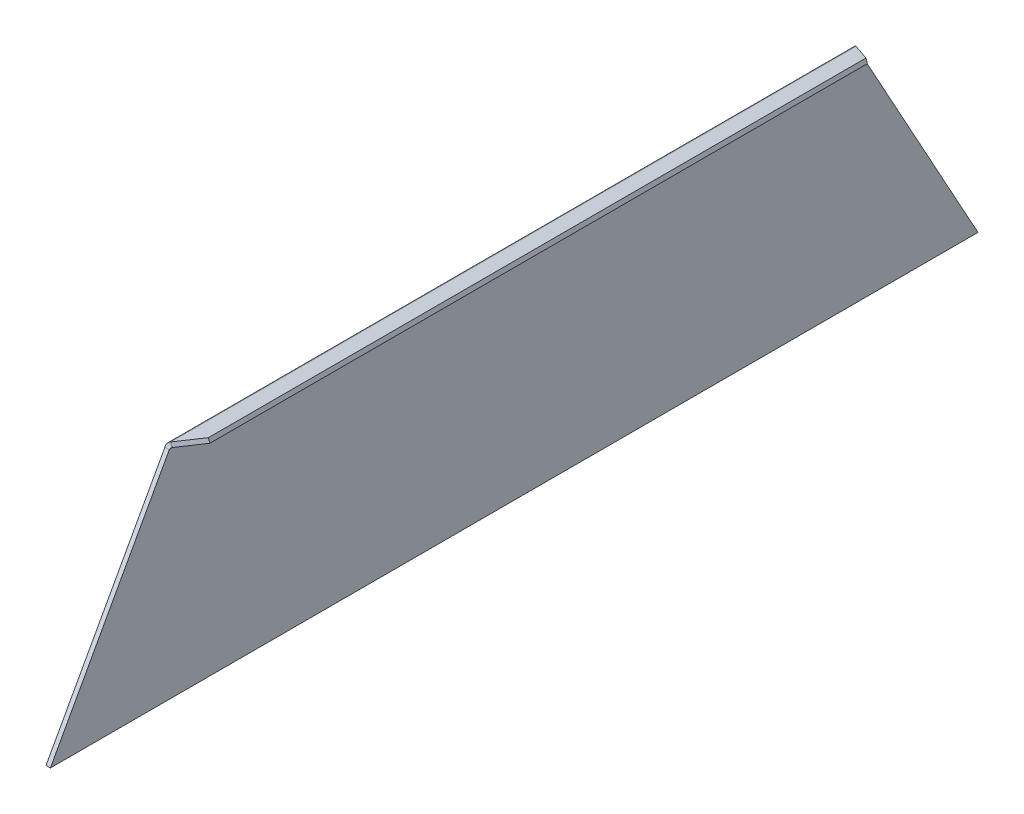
ISO-10303-21;
HEADER;
FILE_DESCRIPTION(('STEP AP214'),'2;1');
FILE_NAME('part.step','',(''),(''),'','','');
FILE_SCHEMA(('AUTOMOTIVE_DESIGN { 1 0 10303 214 1 1 1 1 }'));
ENDSEC;
DATA;
#1=APPLICATION_CONTEXT('core data for automotive mechanical design processes');
#2=APPLICATION_PROTOCOL_DEFINITION('international standard','automotive_design',2000,#1);
#3=PRODUCT_CONTEXT('',#1,'mechanical');
#4=PRODUCT('Part','Part','',(#3));
#5=PRODUCT_RELATED_PRODUCT_CATEGORY('part','',(#4));
#6=PRODUCT_DEFINITION_FORMATION('','',#4);
#7=PRODUCT_DEFINITION_CONTEXT('part definition',#1,'design');
#8=PRODUCT_DEFINITION('design','',#6,#7);
#9=PRODUCT_DEFINITION_SHAPE('','',#8);
#10=(LENGTH_UNIT() NAMED_UNIT(*) SI_UNIT(.MILLI.,.METRE.));
#11=(NAMED_UNIT(*) PLANE_ANGLE_UNIT() SI_UNIT($,.RADIAN.));
#12=(NAMED_UNIT(*) SI_UNIT($,.STERADIAN.) SOLID_ANGLE_UNIT());
#13=UNCERTAINTY_MEASURE_WITH_UNIT(LENGTH_MEASURE(1.E-05),#10,'distance_accuracy_value','');
#14=(GEOMETRIC_REPRESENTATION_CONTEXT(3) GLOBAL_UNCERTAINTY_ASSIGNED_CONTEXT((#13)) GLOBAL_UNIT_ASSIGNED_CONTEXT((#10,
#11,#12)) REPRESENTATION_CONTEXT('',''));
#15=CARTESIAN_POINT('',(0.,0.,0.));
#16=DIRECTION('',(0.,0.,1.));
#17=DIRECTION('',(1.,0.,0.));
#18=AXIS2_PLACEMENT_3D('',#15,#16,#17);
#19=CARTESIAN_POINT('',(50.120276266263,421.579172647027,602.5));
#20=DIRECTION('',(-0.342020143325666,0.93969262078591,0.));
#21=DIRECTION('',(0.,0.,1.));
#22=AXIS2_PLACEMENT_3D('',#19,#20,#21);
#23=PLANE('',#22);
#24=DIRECTION('',(0.823373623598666,0.299683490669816,0.481918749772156));
#25=VECTOR('',#24,1.);
#26=CARTESIAN_POINT('',(-372.741403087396,267.670108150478,-850.));
#27=LINE('',#26,#25);
#28=CARTESIAN_POINT('',(6.57979856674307,405.731734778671,-627.984144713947));
#29=VERTEX_POINT('',#28);
#30=CARTESIAN_POINT('',(50.1202762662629,421.579172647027,-602.5));
#31=VERTEX_POINT('',#30);
#32=EDGE_CURVE('E78',#29,#31,#27,.T.);
#33=ORIENTED_EDGE('',*,*,#32,.F.);
#34=DIRECTION('',(0.,0.,1.));
#35=VECTOR('',#34,1.);
#36=CARTESIAN_POINT('',(6.57979856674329,405.731734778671,602.5));
#37=LINE('',#36,#35);
#38=CARTESIAN_POINT('',(6.57979856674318,405.731734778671,627.984144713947));
#39=VERTEX_POINT('',#38);
#40=EDGE_CURVE('E71',#29,#39,#37,.T.);
#41=ORIENTED_EDGE('',*,*,#40,.T.);
#42=DIRECTION('',(-0.823373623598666,-0.299683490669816,0.481918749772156));
#43=VECTOR('',#42,1.);
#44=CARTESIAN_POINT('',(-372.741403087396,267.670108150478,850.));
#45=LINE('',#44,#43);
#46=CARTESIAN_POINT('',(50.120276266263,421.579172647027,602.5));
#47=VERTEX_POINT('',#46);
#48=EDGE_CURVE('E86',#47,#39,#45,.T.);
#49=ORIENTED_EDGE('',*,*,#48,.F.);
#50=DIRECTION('',(0.,0.,1.));
#51=VECTOR('',#50,1.);
#52=CARTESIAN_POINT('',(50.120276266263,421.579172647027,602.5));
#53=LINE('',#52,#51);
#54=EDGE_CURVE('E431',#31,#47,#53,.T.);
#55=ORIENTED_EDGE('',*,*,#54,.F.);
#56=EDGE_LOOP('',(#33,#41,#49,#55));
#57=FACE_BOUND('',#56,.T.);
#58=ADVANCED_FACE('F59',(#57),#23,.T.);
#59=CARTESIAN_POINT('',(-370.005241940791,260.15256718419,850.));
#60=DIRECTION('',(-0.452855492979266,-0.164825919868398,-0.876215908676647));
#61=DIRECTION('',(0.823373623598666,0.299683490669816,-0.481918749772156));
#62=AXIS2_PLACEMENT_3D('',#59,#60,#61);
#63=PLANE('',#62);
#64=CARTESIAN_POINT('',(9.31595971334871,398.214193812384,627.984144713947));
#65=CARTESIAN_POINT('',(6.57979856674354,405.731734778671,627.984144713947));
#66=B_SPLINE_CURVE_WITH_KNOTS('',1,(#64,#65),.UNSPECIFIED.,.F.,.F.,(2,2),(0.,1.),.UNSPECIFIED.);
#67=CARTESIAN_POINT('',(9.31595971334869,398.214193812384,627.984144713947));
#68=VERTEX_POINT('',#67);
#69=EDGE_CURVE('E350',#68,#39,#66,.T.);
#70=ORIENTED_EDGE('',*,*,#69,.F.);
#71=DIRECTION('',(-0.823373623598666,-0.299683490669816,0.481918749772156));
#72=VECTOR('',#71,1.);
#73=CARTESIAN_POINT('',(-370.005241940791,260.15256718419,850.));
#74=LINE('',#73,#72);
#75=CARTESIAN_POINT('',(52.8564374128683,414.06163168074,602.5));
#76=VERTEX_POINT('',#75);
#77=EDGE_CURVE('E439',#76,#68,#74,.T.);
#78=ORIENTED_EDGE('',*,*,#77,.F.);
#79=DIRECTION('',(-0.342020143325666,0.93969262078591,0.));
#80=VECTOR('',#79,1.);
#81=CARTESIAN_POINT('',(52.8564374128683,414.06163168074,602.5));
#82=LINE('',#81,#80);
#83=EDGE_CURVE('E450',#76,#47,#82,.T.);
#84=ORIENTED_EDGE('',*,*,#83,.T.);
#85=ORIENTED_EDGE('',*,*,#48,.T.);
#86=EDGE_LOOP('',(#70,#78,#84,#85));
#87=FACE_BOUND('',#86,.T.);
#88=ADVANCED_FACE('F201',(#87),#63,.F.);
#89=CARTESIAN_POINT('',(-370.005241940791,260.15256718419,-850.));
#90=DIRECTION('',(-0.452855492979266,-0.164825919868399,0.876215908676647));
#91=DIRECTION('',(-0.823373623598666,-0.299683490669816,-0.481918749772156));
#92=AXIS2_PLACEMENT_3D('',#89,#90,#91);
#93=PLANE('',#92);
#94=CARTESIAN_POINT('',(6.57979856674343,405.731734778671,-627.984144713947));
#95=CARTESIAN_POINT('',(9.31595971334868,398.214193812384,-627.984144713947));
#96=B_SPLINE_CURVE_WITH_KNOTS('',1,(#94,#95),.UNSPECIFIED.,.F.,.F.,(2,2),(0.,1.),.UNSPECIFIED.);
#97=CARTESIAN_POINT('',(9.31595971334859,398.214193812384,-627.984144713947));
#98=VERTEX_POINT('',#97);
#99=EDGE_CURVE('E12',#29,#98,#96,.T.);
#100=ORIENTED_EDGE('',*,*,#99,.F.);
#101=ORIENTED_EDGE('',*,*,#32,.T.);
#102=DIRECTION('',(-0.342020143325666,0.93969262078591,0.));
#103=VECTOR('',#102,1.);
#104=CARTESIAN_POINT('',(52.8564374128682,414.06163168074,-602.5));
#105=LINE('',#104,#103);
#106=CARTESIAN_POINT('',(52.8564374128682,414.06163168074,-602.5));
#107=VERTEX_POINT('',#106);
#108=EDGE_CURVE('E447',#107,#31,#105,.T.);
#109=ORIENTED_EDGE('',*,*,#108,.F.);
#110=DIRECTION('',(0.823373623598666,0.299683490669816,0.481918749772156));
#111=VECTOR('',#110,1.);
#112=CARTESIAN_POINT('',(-370.005241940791,260.15256718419,-850.));
#113=LINE('',#112,#111);
#114=EDGE_CURVE('E445',#98,#107,#113,.T.);
#115=ORIENTED_EDGE('',*,*,#114,.F.);
#116=EDGE_LOOP('',(#100,#101,#109,#115));
#117=FACE_BOUND('',#116,.T.);
#118=ADVANCED_FACE('F61',(#117),#93,.F.);
#119=CARTESIAN_POINT('',(52.8564374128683,414.06163168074,602.5));
#120=DIRECTION('',(-0.93969262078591,-0.342020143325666,0.));
#121=DIRECTION('',(0.,0.,-1.));
#122=AXIS2_PLACEMENT_3D('',#119,#120,#121);
#123=PLANE('',#122);
#124=ORIENTED_EDGE('',*,*,#54,.T.);
#125=ORIENTED_EDGE('',*,*,#83,.F.);
#126=DIRECTION('',(0.,0.,1.));
#127=VECTOR('',#126,1.);
#128=CARTESIAN_POINT('',(52.8564374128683,414.06163168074,602.5));
#129=LINE('',#128,#127);
#130=EDGE_CURVE('E443',#107,#76,#129,.T.);
#131=ORIENTED_EDGE('',*,*,#130,.F.);
#132=ORIENTED_EDGE('',*,*,#108,.T.);
#133=EDGE_LOOP('',(#124,#125,#131,#132));
#134=FACE_BOUND('',#133,.T.);
#135=ADVANCED_FACE('F193',(#134),#123,.F.);
#136=CARTESIAN_POINT('',(52.8564374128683,414.06163168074,602.5));
#137=DIRECTION('',(-0.342020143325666,0.93969262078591,0.));
#138=DIRECTION('',(0.,0.,1.));
#139=AXIS2_PLACEMENT_3D('',#136,#137,#138);
#140=PLANE('',#139);
#141=DIRECTION('',(0.,0.,1.));
#142=VECTOR('',#141,1.);
#143=CARTESIAN_POINT('',(9.31595971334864,398.214193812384,602.5));
#144=LINE('',#143,#142);
#145=EDGE_CURVE('E440',#98,#68,#144,.T.);
#146=ORIENTED_EDGE('',*,*,#145,.F.);
#147=ORIENTED_EDGE('',*,*,#114,.T.);
#148=ORIENTED_EDGE('',*,*,#130,.T.);
#149=ORIENTED_EDGE('',*,*,#77,.T.);
#150=EDGE_LOOP('',(#146,#147,#148,#149));
#151=FACE_BOUND('',#150,.T.);
#152=ADVANCED_FACE('F196',(#151),#140,.F.);
#153=CARTESIAN_POINT('',(8.,0.,850.));
#154=DIRECTION('',(0.,1.,0.));
#155=DIRECTION('',(0.,0.,1.));
#156=AXIS2_PLACEMENT_3D('',#153,#154,#155);
#157=PLANE('',#156);
#158=DIRECTION('',(0.,0.,-1.));
#159=VECTOR('',#158,1.);
#160=CARTESIAN_POINT('',(0.,0.,850.));
#161=LINE('',#160,#159);
#162=CARTESIAN_POINT('',(0.,0.,850.));
#163=VERTEX_POINT('',#162);
#164=CARTESIAN_POINT('',(0.,0.,-850.));
#165=VERTEX_POINT('',#164);
#166=EDGE_CURVE('E358',#163,#165,#161,.T.);
#167=ORIENTED_EDGE('',*,*,#166,.T.);
#168=DIRECTION('',(-1.,0.,0.));
#169=VECTOR('',#168,1.);
#170=CARTESIAN_POINT('',(8.,0.,-850.));
#171=LINE('',#170,#169);
#172=CARTESIAN_POINT('',(8.,0.,-850.));
#173=VERTEX_POINT('',#172);
#174=EDGE_CURVE('E173',#173,#165,#171,.T.);
#175=ORIENTED_EDGE('',*,*,#174,.F.);
#176=DIRECTION('',(0.,0.,-1.));
#177=VECTOR('',#176,1.);
#178=CARTESIAN_POINT('',(8.,0.,850.));
#179=LINE('',#178,#177);
#180=CARTESIAN_POINT('',(8.,0.,850.));
#181=VERTEX_POINT('',#180);
#182=EDGE_CURVE('E161',#181,#173,#179,.T.);
#183=ORIENTED_EDGE('',*,*,#182,.F.);
#184=DIRECTION('',(-1.,0.,0.));
#185=VECTOR('',#184,1.);
#186=CARTESIAN_POINT('',(8.,0.,850.));
#187=LINE('',#186,#185);
#188=EDGE_CURVE('E165',#181,#163,#187,.T.);
#189=ORIENTED_EDGE('',*,*,#188,.T.);
#190=EDGE_LOOP('',(#167,#175,#183,#189));
#191=FACE_BOUND('',#190,.T.);
#192=ADVANCED_FACE('F199',(#191),#157,.F.);
#193=CARTESIAN_POINT('',(8.,450.,602.5));
#194=DIRECTION('',(-1.,0.,0.));
#195=DIRECTION('',(0.,0.,1.));
#196=AXIS2_PLACEMENT_3D('',#193,#194,#195);
#197=PLANE('',#196);
#198=DIRECTION('',(0.,0.876215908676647,0.481918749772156));
#199=VECTOR('',#198,1.);
#200=CARTESIAN_POINT('',(8.,0.,-850.));
#201=LINE('',#200,#199);
#202=CARTESIAN_POINT('',(8.,396.334808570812,-632.015855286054));
#203=VERTEX_POINT('',#202);
#204=EDGE_CURVE('E156',#173,#203,#201,.T.);
#205=ORIENTED_EDGE('',*,*,#204,.T.);
#206=DIRECTION('',(0.,0.,1.));
#207=VECTOR('',#206,1.);
#208=CARTESIAN_POINT('',(8.,396.334808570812,602.5));
#209=LINE('',#208,#207);
#210=CARTESIAN_POINT('',(8.,396.334808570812,632.015855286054));
#211=VERTEX_POINT('',#210);
#212=EDGE_CURVE('E148',#203,#211,#209,.T.);
#213=ORIENTED_EDGE('',*,*,#212,.T.);
#214=DIRECTION('',(0.,-0.876215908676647,0.481918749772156));
#215=VECTOR('',#214,1.);
#216=CARTESIAN_POINT('',(8.,0.,850.));
#217=LINE('',#216,#215);
#218=EDGE_CURVE('E155',#211,#181,#217,.T.);
#219=ORIENTED_EDGE('',*,*,#218,.T.);
#220=ORIENTED_EDGE('',*,*,#182,.T.);
#221=EDGE_LOOP('',(#205,#213,#219,#220));
#222=FACE_BOUND('',#221,.T.);
#223=ADVANCED_FACE('F159',(#222),#197,.F.);
#224=CARTESIAN_POINT('',(8.,0.,850.));
#225=DIRECTION('',(0.,-0.481918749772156,-0.876215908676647));
#226=DIRECTION('',(0.,0.876215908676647,-0.481918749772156));
#227=AXIS2_PLACEMENT_3D('',#224,#225,#226);
#228=PLANE('',#227);
#229=ORIENTED_EDGE('',*,*,#218,.F.);
#230=CARTESIAN_POINT('',(0.,396.334808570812,632.015855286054));
#231=CARTESIAN_POINT('',(8.,396.334808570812,632.015855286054));
#232=B_SPLINE_CURVE_WITH_KNOTS('',1,(#230,#231),.UNSPECIFIED.,.F.,.F.,(2,2),(0.,1.),.UNSPECIFIED.);
#233=CARTESIAN_POINT('',(0.,396.334808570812,632.015855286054));
#234=VERTEX_POINT('',#233);
#235=EDGE_CURVE('E353',#211,#234,#232,.F.);
#236=ORIENTED_EDGE('',*,*,#235,.T.);
#237=DIRECTION('',(0.,-0.876215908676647,0.481918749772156));
#238=VECTOR('',#237,1.);
#239=CARTESIAN_POINT('',(0.,0.,850.));
#240=LINE('',#239,#238);
#241=EDGE_CURVE('E365',#234,#163,#240,.T.);
#242=ORIENTED_EDGE('',*,*,#241,.T.);
#243=ORIENTED_EDGE('',*,*,#188,.F.);
#244=EDGE_LOOP('',(#229,#236,#242,#243));
#245=FACE_BOUND('',#244,.T.);
#246=ADVANCED_FACE('F247',(#245),#228,.F.);
#247=CARTESIAN_POINT('',(0.,450.,602.5));
#248=DIRECTION('',(-1.,0.,0.));
#249=DIRECTION('',(0.,0.,1.));
#250=AXIS2_PLACEMENT_3D('',#247,#248,#249);
#251=PLANE('',#250);
#252=DIRECTION('',(0.,0.,1.));
#253=VECTOR('',#252,1.);
#254=CARTESIAN_POINT('',(0.,396.334808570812,602.5));
#255=LINE('',#254,#253);
#256=CARTESIAN_POINT('',(0.,396.334808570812,-632.015855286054));
#257=VERTEX_POINT('',#256);
#258=EDGE_CURVE('E356',#257,#234,#255,.T.);
#259=ORIENTED_EDGE('',*,*,#258,.F.);
#260=DIRECTION('',(0.,0.876215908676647,0.481918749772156));
#261=VECTOR('',#260,1.);
#262=CARTESIAN_POINT('',(0.,0.,-850.));
#263=LINE('',#262,#261);
#264=EDGE_CURVE('E171',#165,#257,#263,.T.);
#265=ORIENTED_EDGE('',*,*,#264,.F.);
#266=ORIENTED_EDGE('',*,*,#166,.F.);
#267=ORIENTED_EDGE('',*,*,#241,.F.);
#268=EDGE_LOOP('',(#259,#265,#266,#267));
#269=FACE_BOUND('',#268,.T.);
#270=ADVANCED_FACE('F191',(#269),#251,.T.);
#271=CARTESIAN_POINT('',(8.,0.,-850.));
#272=DIRECTION('',(0.,-0.481918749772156,0.876215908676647));
#273=DIRECTION('',(0.,-0.876215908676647,-0.481918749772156));
#274=AXIS2_PLACEMENT_3D('',#271,#272,#273);
#275=PLANE('',#274);
#276=ORIENTED_EDGE('',*,*,#264,.T.);
#277=CARTESIAN_POINT('',(8.,396.334808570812,-632.015855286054));
#278=CARTESIAN_POINT('',(0.,396.334808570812,-632.015855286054));
#279=B_SPLINE_CURVE_WITH_KNOTS('',1,(#277,#278),.UNSPECIFIED.,.F.,.F.,(2,2),(0.,1.),.UNSPECIFIED.);
#280=EDGE_CURVE('E134',#257,#203,#279,.F.);
#281=ORIENTED_EDGE('',*,*,#280,.T.);
#282=ORIENTED_EDGE('',*,*,#204,.F.);
#283=ORIENTED_EDGE('',*,*,#174,.T.);
#284=EDGE_LOOP('',(#276,#281,#282,#283));
#285=FACE_BOUND('',#284,.T.);
#286=ADVANCED_FACE('F169',(#285),#275,.F.);
#287=CARTESIAN_POINT('',(0.,396.334808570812,-632.015855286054));
#288=CARTESIAN_POINT('',(0.,398.372940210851,-631.343271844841));
#289=CARTESIAN_POINT('',(0.640553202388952,400.402601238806,-630.671951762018));
#290=CARTESIAN_POINT('',(2.97640591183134,403.738544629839,-629.328048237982));
#291=CARTESIAN_POINT('',(4.66458130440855,405.034652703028,-628.656728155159));
#292=CARTESIAN_POINT('',(6.57979856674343,405.731734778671,-627.984144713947));
#293=CARTESIAN_POINT('',(8.,396.334808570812,-632.015855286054));
#294=CARTESIAN_POINT('',(8.,396.742166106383,-631.343715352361));
#295=CARTESIAN_POINT('',(8.12811064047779,397.148367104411,-630.671951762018));
#296=CARTESIAN_POINT('',(8.59528118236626,397.815555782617,-629.328048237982));
#297=CARTESIAN_POINT('',(8.9331688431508,398.074869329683,-628.656284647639));
#298=CARTESIAN_POINT('',(9.31595971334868,398.214193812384,-627.984144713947));
#299=B_SPLINE_SURFACE_WITH_KNOTS('',1,3,((#287,#288,#289,#290,#291,#292),(#293,#294,#295,#296,
#297,#298)),.UNSPECIFIED.,.F.,.F.,.F.,(2,2),(4,2,4),(0.,1.),(0.,0.5,1.),.UNSPECIFIED.);
#300=CARTESIAN_POINT('',(0.,396.334808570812,-632.015855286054));
#301=CARTESIAN_POINT('',(0.,398.372940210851,-631.343271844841));
#302=CARTESIAN_POINT('',(0.640553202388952,400.402601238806,-630.671951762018));
#303=CARTESIAN_POINT('',(2.97640591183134,403.738544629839,-629.328048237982));
#304=CARTESIAN_POINT('',(4.66458130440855,405.034652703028,-628.656728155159));
#305=CARTESIAN_POINT('',(6.57979856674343,405.731734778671,-627.984144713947));
#306=B_SPLINE_CURVE_WITH_KNOTS('',3,(#300,#301,#302,#303,#304,#305),.UNSPECIFIED.,.F.,.F.,(4,2,
4),(0.,0.5,1.),.UNSPECIFIED.);
#307=EDGE_CURVE('E321',#257,#29,#306,.T.);
#308=CARTESIAN_POINT('',(9.31595971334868,398.214193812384,-627.984144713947));
#309=CARTESIAN_POINT('',(8.9331688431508,398.074869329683,-628.656284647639));
#310=CARTESIAN_POINT('',(8.59528118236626,397.815555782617,-629.328048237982));
#311=CARTESIAN_POINT('',(8.12811064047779,397.148367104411,-630.671951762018));
#312=CARTESIAN_POINT('',(8.,396.742166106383,-631.343715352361));
#313=CARTESIAN_POINT('',(8.,396.334808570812,-632.015855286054));
#314=B_SPLINE_CURVE_WITH_KNOTS('',3,(#308,#309,#310,#311,#312,#313),.UNSPECIFIED.,.F.,.F.,(4,2,
4),(0.,0.5,1.),.UNSPECIFIED.);
#315=EDGE_CURVE('E128',#203,#98,#314,.F.);
#316=ORIENTED_EDGE('',*,*,#280,.F.);
#317=ORIENTED_EDGE('',*,*,#307,.T.);
#318=ORIENTED_EDGE('',*,*,#99,.T.);
#319=ORIENTED_EDGE('',*,*,#315,.F.);
#320=EDGE_LOOP('',(#316,#317,#318,#319));
#321=FACE_BOUND('',#320,.T.);
#322=ADVANCED_FACE('F131',(#321),#299,.F.);
#323=CARTESIAN_POINT('',(6.57979856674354,405.731734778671,627.984144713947));
#324=CARTESIAN_POINT('',(4.66458130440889,405.034652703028,628.656728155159));
#325=CARTESIAN_POINT('',(2.9764059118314,403.738544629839,629.328048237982));
#326=CARTESIAN_POINT('',(0.640553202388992,400.402601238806,630.671951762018));
#327=CARTESIAN_POINT('',(0.,398.372940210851,631.343271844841));
#328=CARTESIAN_POINT('',(0.,396.334808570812,632.015855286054));
#329=CARTESIAN_POINT('',(9.31595971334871,398.214193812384,627.984144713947));
#330=CARTESIAN_POINT('',(8.93316884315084,398.074869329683,628.656284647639));
#331=CARTESIAN_POINT('',(8.59528118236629,397.815555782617,629.328048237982));
#332=CARTESIAN_POINT('',(8.1281106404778,397.148367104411,630.671951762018));
#333=CARTESIAN_POINT('',(8.00000000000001,396.742166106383,631.343715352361));
#334=CARTESIAN_POINT('',(8.,396.334808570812,632.015855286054));
#335=B_SPLINE_SURFACE_WITH_KNOTS('',1,3,((#323,#324,#325,#326,#327,#328),(#329,#330,#331,#332,
#333,#334)),.UNSPECIFIED.,.F.,.F.,.F.,(2,2),(4,2,4),(0.,1.),(0.,0.5,1.),.UNSPECIFIED.);
#336=CARTESIAN_POINT('',(6.57979856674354,405.731734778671,627.984144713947));
#337=CARTESIAN_POINT('',(4.66458130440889,405.034652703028,628.656728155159));
#338=CARTESIAN_POINT('',(2.9764059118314,403.738544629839,629.328048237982));
#339=CARTESIAN_POINT('',(0.640553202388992,400.402601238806,630.671951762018));
#340=CARTESIAN_POINT('',(0.,398.372940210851,631.343271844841));
#341=CARTESIAN_POINT('',(0.,396.334808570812,632.015855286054));
#342=B_SPLINE_CURVE_WITH_KNOTS('',3,(#336,#337,#338,#339,#340,#341),.UNSPECIFIED.,.F.,.F.,(4,2,
4),(0.,0.5,1.),.UNSPECIFIED.);
#343=EDGE_CURVE('E143',#39,#234,#342,.T.);
#344=CARTESIAN_POINT('',(8.,396.334808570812,632.015855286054));
#345=CARTESIAN_POINT('',(8.00000000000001,396.742166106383,631.343715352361));
#346=CARTESIAN_POINT('',(8.1281106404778,397.148367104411,630.671951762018));
#347=CARTESIAN_POINT('',(8.59528118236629,397.815555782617,629.328048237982));
#348=CARTESIAN_POINT('',(8.93316884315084,398.074869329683,628.656284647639));
#349=CARTESIAN_POINT('',(9.31595971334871,398.214193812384,627.984144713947));
#350=B_SPLINE_CURVE_WITH_KNOTS('',3,(#344,#345,#346,#347,#348,#349),.UNSPECIFIED.,.F.,.F.,(4,2,
4),(0.,0.5,1.),.UNSPECIFIED.);
#351=EDGE_CURVE('E142',#68,#211,#350,.F.);
#352=ORIENTED_EDGE('',*,*,#69,.T.);
#353=ORIENTED_EDGE('',*,*,#343,.T.);
#354=ORIENTED_EDGE('',*,*,#235,.F.);
#355=ORIENTED_EDGE('',*,*,#351,.F.);
#356=EDGE_LOOP('',(#352,#353,#354,#355));
#357=FACE_BOUND('',#356,.T.);
#358=ADVANCED_FACE('F269',(#357),#335,.F.);
#359=CARTESIAN_POINT('',(10.,396.334808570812,-1264.07828074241));
#360=DIRECTION('',(0.,0.,1.));
#361=DIRECTION('',(0.,-1.,0.));
#362=AXIS2_PLACEMENT_3D('',#359,#360,#361);
#363=CYLINDRICAL_SURFACE('',#362,2.);
#364=ORIENTED_EDGE('',*,*,#351,.T.);
#365=ORIENTED_EDGE('',*,*,#212,.F.);
#366=ORIENTED_EDGE('',*,*,#315,.T.);
#367=ORIENTED_EDGE('',*,*,#145,.T.);
#368=EDGE_LOOP('',(#364,#365,#366,#367));
#369=FACE_BOUND('',#368,.T.);
#370=ADVANCED_FACE('F150',(#369),#363,.F.);
#371=CARTESIAN_POINT('',(10.,396.334808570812,-1264.07828074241));
#372=DIRECTION('',(0.,0.,1.));
#373=DIRECTION('',(0.,-1.,0.));
#374=AXIS2_PLACEMENT_3D('',#371,#372,#373);
#375=CYLINDRICAL_SURFACE('',#374,10.);
#376=ORIENTED_EDGE('',*,*,#343,.F.);
#377=ORIENTED_EDGE('',*,*,#40,.F.);
#378=ORIENTED_EDGE('',*,*,#307,.F.);
#379=ORIENTED_EDGE('',*,*,#258,.T.);
#380=EDGE_LOOP('',(#376,#377,#378,#379));
#381=FACE_BOUND('',#380,.T.);
#382=ADVANCED_FACE('F284',(#381),#375,.T.);
#383=CLOSED_SHELL('',(#58,#88,#118,#135,#152,#192,#223,#246,#270,#286,#322,#358,#370,#382));
#384=MANIFOLD_SOLID_BREP('B2',#383);
#385=ADVANCED_BREP_SHAPE_REPRESENTATION('',(#18,#384),#14);
#386=SHAPE_DEFINITION_REPRESENTATION(#9,#385);
ENDSEC;
END-ISO-10303-21;
